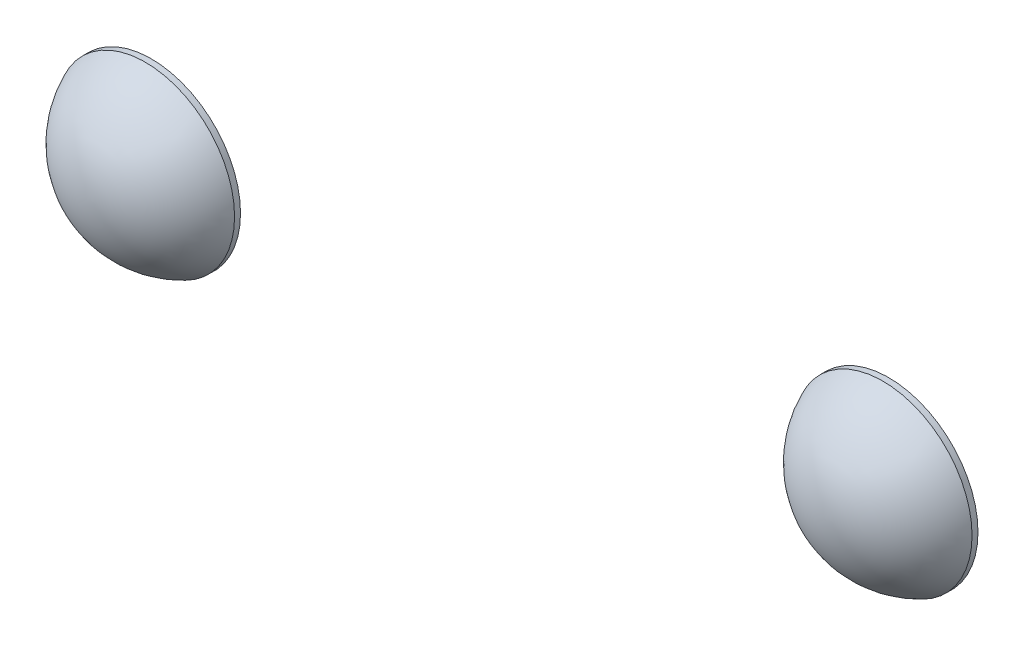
from build123d import *

# Parameters (mm, degrees)
ESQUISSE1_R        = 3
EXTRUSION1_DEPTH   = 0.2
EXTRUSION1_2_DEPTH = 0.2
D_ME1_FACE_RADIUS  = 3
D_ME1_HEIGHT       = 2
D_ME2_FACE_RADIUS  = 3
D_ME2_HEIGHT       = 2


with BuildPart() as part:
    # Esquisse1 → Extrusion1 (new body)
    with BuildSketch(Plane.XY.offset(-9.199999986)):
        with Locations((-0.194783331, 3.11467912)):
            Circle(ESQUISSE1_R)
    extrude(amount=-EXTRUSION1_DEPTH)

    # D_me2: a dome of height H over a round flat face of radius A is a cap of a sphere of radius (A * A + H * H) / (2 * H)
    d_me2_r = (D_ME2_FACE_RADIUS * D_ME2_FACE_RADIUS + D_ME2_HEIGHT * D_ME2_HEIGHT) / (2 * D_ME2_HEIGHT)
    d_me2_base = Plane((-0.194783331, 3.11467912, -9.199999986), z_dir=(0, 0, 1))
    with Locations(d_me2_base.offset(D_ME2_HEIGHT - d_me2_r)):
        d_me2_ball = Sphere(d_me2_r, mode=Mode.PRIVATE)
    add(split(d_me2_ball, bisect_by=d_me2_base, keep=Keep.TOP, mode=Mode.PRIVATE))


with BuildPart() as body_2:
    # Esquisse1 → Extrusion1 2 (new body)
    with BuildSketch(Plane.XY.offset(-9.199999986)):
        with Locations((-25, 0)):
            Circle(ESQUISSE1_R)
    extrude(amount=-EXTRUSION1_2_DEPTH)

    # D_me1: a dome of height H over a round flat face of radius A is a cap of a sphere of radius (A * A + H * H) / (2 * H)
    d_me1_r = (D_ME1_FACE_RADIUS * D_ME1_FACE_RADIUS + D_ME1_HEIGHT * D_ME1_HEIGHT) / (2 * D_ME1_HEIGHT)
    d_me1_base = Plane((-25, 0, -9.199999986), z_dir=(0, 0, 1))
    with Locations(d_me1_base.offset(D_ME1_HEIGHT - d_me1_r)):
        d_me1_ball = Sphere(d_me1_r, mode=Mode.PRIVATE)
    add(split(d_me1_ball, bisect_by=d_me1_base, keep=Keep.TOP, mode=Mode.PRIVATE))


solid = Compound([part.part, body_2.part])
